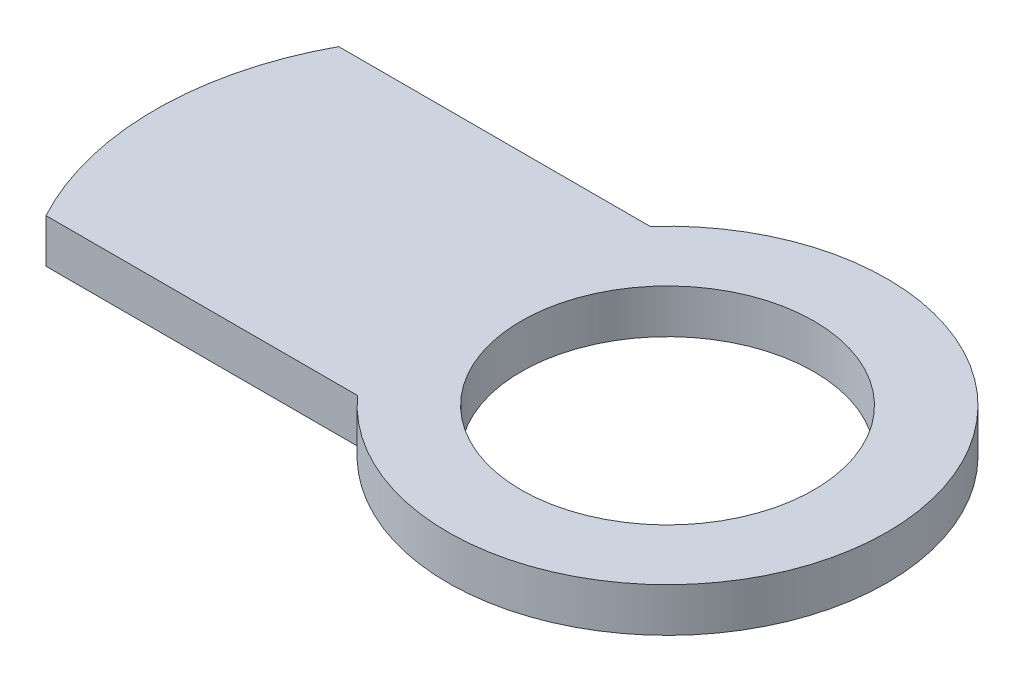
ISO-10303-21;
HEADER;
FILE_DESCRIPTION(('STEP AP214'),'2;1');
FILE_NAME('part.step','',(''),(''),'','','');
FILE_SCHEMA(('AUTOMOTIVE_DESIGN { 1 0 10303 214 1 1 1 1 }'));
ENDSEC;
DATA;
#1=APPLICATION_CONTEXT('core data for automotive mechanical design processes');
#2=APPLICATION_PROTOCOL_DEFINITION('international standard','automotive_design',2000,#1);
#3=PRODUCT_CONTEXT('',#1,'mechanical');
#4=PRODUCT('Part','Part','',(#3));
#5=PRODUCT_RELATED_PRODUCT_CATEGORY('part','',(#4));
#6=PRODUCT_DEFINITION_FORMATION('','',#4);
#7=PRODUCT_DEFINITION_CONTEXT('part definition',#1,'design');
#8=PRODUCT_DEFINITION('design','',#6,#7);
#9=PRODUCT_DEFINITION_SHAPE('','',#8);
#10=(LENGTH_UNIT() NAMED_UNIT(*) SI_UNIT(.MILLI.,.METRE.));
#11=(NAMED_UNIT(*) PLANE_ANGLE_UNIT() SI_UNIT($,.RADIAN.));
#12=(NAMED_UNIT(*) SI_UNIT($,.STERADIAN.) SOLID_ANGLE_UNIT());
#13=UNCERTAINTY_MEASURE_WITH_UNIT(LENGTH_MEASURE(1.E-05),#10,'distance_accuracy_value','');
#14=(GEOMETRIC_REPRESENTATION_CONTEXT(3) GLOBAL_UNCERTAINTY_ASSIGNED_CONTEXT((#13)) GLOBAL_UNIT_ASSIGNED_CONTEXT((#10,
#11,#12)) REPRESENTATION_CONTEXT('',''));
#15=CARTESIAN_POINT('',(0.,0.,0.));
#16=DIRECTION('',(0.,0.,1.));
#17=DIRECTION('',(1.,0.,0.));
#18=AXIS2_PLACEMENT_3D('',#15,#16,#17);
#19=CARTESIAN_POINT('',(0.,3.,0.));
#20=DIRECTION('',(0.,1.,0.));
#21=DIRECTION('',(0.,0.,1.));
#22=AXIS2_PLACEMENT_3D('',#19,#20,#21);
#23=PLANE('',#22);
#24=CARTESIAN_POINT('',(0.,3.,0.));
#25=DIRECTION('',(0.,1.,0.));
#26=DIRECTION('',(0.,0.,1.));
#27=AXIS2_PLACEMENT_3D('',#24,#25,#26);
#28=CIRCLE('',#27,15.);
#29=CARTESIAN_POINT('',(-11.1803398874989,3.,10.));
#30=VERTEX_POINT('',#29);
#31=CARTESIAN_POINT('',(-11.1803398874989,3.,-10.));
#32=VERTEX_POINT('',#31);
#33=EDGE_CURVE('E83',#30,#32,#28,.T.);
#34=ORIENTED_EDGE('',*,*,#33,.T.);
#35=DIRECTION('',(-1.,0.,0.));
#36=VECTOR('',#35,1.);
#37=CARTESIAN_POINT('',(-11.1803398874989,3.,-10.));
#38=LINE('',#37,#36);
#39=CARTESIAN_POINT('',(-32.4661853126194,3.,-10.));
#40=VERTEX_POINT('',#39);
#41=EDGE_CURVE('E78',#32,#40,#38,.T.);
#42=ORIENTED_EDGE('',*,*,#41,.T.);
#43=CARTESIAN_POINT('',(-14.,3.,0.));
#44=DIRECTION('',(0.,1.,0.));
#45=DIRECTION('',(0.,0.,1.));
#46=AXIS2_PLACEMENT_3D('',#43,#44,#45);
#47=CIRCLE('',#46,21.);
#48=CARTESIAN_POINT('',(-32.4661853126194,3.,10.));
#49=VERTEX_POINT('',#48);
#50=EDGE_CURVE('E81',#40,#49,#47,.T.);
#51=ORIENTED_EDGE('',*,*,#50,.T.);
#52=DIRECTION('',(1.,0.,0.));
#53=VECTOR('',#52,1.);
#54=CARTESIAN_POINT('',(-11.1803398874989,3.,10.));
#55=LINE('',#54,#53);
#56=EDGE_CURVE('E48',#49,#30,#55,.T.);
#57=ORIENTED_EDGE('',*,*,#56,.T.);
#58=EDGE_LOOP('',(#34,#42,#51,#57));
#59=FACE_BOUND('',#58,.T.);
#60=CARTESIAN_POINT('',(0.,3.,0.));
#61=DIRECTION('',(0.,1.,0.));
#62=DIRECTION('',(0.,0.,1.));
#63=AXIS2_PLACEMENT_3D('',#60,#61,#62);
#64=CIRCLE('',#63,10.);
#65=CARTESIAN_POINT('',(0.,3.,10.));
#66=VERTEX_POINT('',#65);
#67=EDGE_CURVE('E98',#66,#66,#64,.T.);
#68=ORIENTED_EDGE('',*,*,#67,.F.);
#69=EDGE_LOOP('',(#68));
#70=FACE_BOUND('',#69,.T.);
#71=ADVANCED_FACE('F31',(#59,#70),#23,.T.);
#72=CARTESIAN_POINT('',(0.,0.,0.));
#73=DIRECTION('',(0.,1.,0.));
#74=DIRECTION('',(0.,0.,1.));
#75=AXIS2_PLACEMENT_3D('',#72,#73,#74);
#76=PLANE('',#75);
#77=CARTESIAN_POINT('',(0.,0.,0.));
#78=DIRECTION('',(0.,1.,0.));
#79=DIRECTION('',(0.,0.,1.));
#80=AXIS2_PLACEMENT_3D('',#77,#78,#79);
#81=CIRCLE('',#80,15.);
#82=CARTESIAN_POINT('',(-11.1803398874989,0.,10.));
#83=VERTEX_POINT('',#82);
#84=CARTESIAN_POINT('',(-11.1803398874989,0.,-10.));
#85=VERTEX_POINT('',#84);
#86=EDGE_CURVE('E95',#83,#85,#81,.T.);
#87=ORIENTED_EDGE('',*,*,#86,.F.);
#88=DIRECTION('',(1.,0.,0.));
#89=VECTOR('',#88,1.);
#90=CARTESIAN_POINT('',(-11.1803398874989,0.,10.));
#91=LINE('',#90,#89);
#92=CARTESIAN_POINT('',(-32.4661853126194,0.,10.));
#93=VERTEX_POINT('',#92);
#94=EDGE_CURVE('E71',#93,#83,#91,.T.);
#95=ORIENTED_EDGE('',*,*,#94,.F.);
#96=CARTESIAN_POINT('',(-14.,0.,0.));
#97=DIRECTION('',(0.,1.,0.));
#98=DIRECTION('',(0.,0.,1.));
#99=AXIS2_PLACEMENT_3D('',#96,#97,#98);
#100=CIRCLE('',#99,21.);
#101=CARTESIAN_POINT('',(-32.4661853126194,0.,-10.));
#102=VERTEX_POINT('',#101);
#103=EDGE_CURVE('E65',#102,#93,#100,.T.);
#104=ORIENTED_EDGE('',*,*,#103,.F.);
#105=DIRECTION('',(-1.,0.,0.));
#106=VECTOR('',#105,1.);
#107=CARTESIAN_POINT('',(-11.1803398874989,0.,-10.));
#108=LINE('',#107,#106);
#109=EDGE_CURVE('E87',#85,#102,#108,.T.);
#110=ORIENTED_EDGE('',*,*,#109,.F.);
#111=EDGE_LOOP('',(#87,#95,#104,#110));
#112=FACE_BOUND('',#111,.T.);
#113=CARTESIAN_POINT('',(0.,0.,0.));
#114=DIRECTION('',(0.,1.,0.));
#115=DIRECTION('',(0.,0.,1.));
#116=AXIS2_PLACEMENT_3D('',#113,#114,#115);
#117=CIRCLE('',#116,10.);
#118=CARTESIAN_POINT('',(0.,0.,10.));
#119=VERTEX_POINT('',#118);
#120=EDGE_CURVE('E110',#119,#119,#117,.T.);
#121=ORIENTED_EDGE('',*,*,#120,.T.);
#122=EDGE_LOOP('',(#121));
#123=FACE_BOUND('',#122,.T.);
#124=ADVANCED_FACE('F106',(#112,#123),#76,.F.);
#125=CARTESIAN_POINT('',(0.,3.,0.));
#126=DIRECTION('',(0.,-1.,0.));
#127=DIRECTION('',(0.,0.,-1.));
#128=AXIS2_PLACEMENT_3D('',#125,#126,#127);
#129=CYLINDRICAL_SURFACE('',#128,15.);
#130=ORIENTED_EDGE('',*,*,#86,.T.);
#131=DIRECTION('',(0.,-1.,0.));
#132=VECTOR('',#131,1.);
#133=CARTESIAN_POINT('',(-11.1803398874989,3.,-10.));
#134=LINE('',#133,#132);
#135=EDGE_CURVE('E11',#32,#85,#134,.T.);
#136=ORIENTED_EDGE('',*,*,#135,.F.);
#137=ORIENTED_EDGE('',*,*,#33,.F.);
#138=DIRECTION('',(0.,-1.,0.));
#139=VECTOR('',#138,1.);
#140=CARTESIAN_POINT('',(-11.1803398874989,3.,10.));
#141=LINE('',#140,#139);
#142=EDGE_CURVE('E91',#30,#83,#141,.T.);
#143=ORIENTED_EDGE('',*,*,#142,.T.);
#144=EDGE_LOOP('',(#130,#136,#137,#143));
#145=FACE_BOUND('',#144,.T.);
#146=ADVANCED_FACE('F33',(#145),#129,.T.);
#147=CARTESIAN_POINT('',(-11.1803398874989,3.,-10.));
#148=DIRECTION('',(0.,0.,1.));
#149=DIRECTION('',(1.,0.,0.));
#150=AXIS2_PLACEMENT_3D('',#147,#148,#149);
#151=PLANE('',#150);
#152=ORIENTED_EDGE('',*,*,#109,.T.);
#153=DIRECTION('',(0.,-1.,0.));
#154=VECTOR('',#153,1.);
#155=CARTESIAN_POINT('',(-32.4661853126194,3.,-10.));
#156=LINE('',#155,#154);
#157=EDGE_CURVE('E40',#40,#102,#156,.T.);
#158=ORIENTED_EDGE('',*,*,#157,.F.);
#159=ORIENTED_EDGE('',*,*,#41,.F.);
#160=ORIENTED_EDGE('',*,*,#135,.T.);
#161=EDGE_LOOP('',(#152,#158,#159,#160));
#162=FACE_BOUND('',#161,.T.);
#163=ADVANCED_FACE('F86',(#162),#151,.F.);
#164=CARTESIAN_POINT('',(-14.,3.,0.));
#165=DIRECTION('',(0.,-1.,0.));
#166=DIRECTION('',(0.,0.,-1.));
#167=AXIS2_PLACEMENT_3D('',#164,#165,#166);
#168=CYLINDRICAL_SURFACE('',#167,21.);
#169=ORIENTED_EDGE('',*,*,#103,.T.);
#170=DIRECTION('',(0.,-1.,0.));
#171=VECTOR('',#170,1.);
#172=CARTESIAN_POINT('',(-32.4661853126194,3.,10.));
#173=LINE('',#172,#171);
#174=EDGE_CURVE('E88',#49,#93,#173,.T.);
#175=ORIENTED_EDGE('',*,*,#174,.F.);
#176=ORIENTED_EDGE('',*,*,#50,.F.);
#177=ORIENTED_EDGE('',*,*,#157,.T.);
#178=EDGE_LOOP('',(#169,#175,#176,#177));
#179=FACE_BOUND('',#178,.T.);
#180=ADVANCED_FACE('F89',(#179),#168,.T.);
#181=CARTESIAN_POINT('',(-11.1803398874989,3.,10.));
#182=DIRECTION('',(0.,0.,-1.));
#183=DIRECTION('',(-1.,0.,0.));
#184=AXIS2_PLACEMENT_3D('',#181,#182,#183);
#185=PLANE('',#184);
#186=ORIENTED_EDGE('',*,*,#94,.T.);
#187=ORIENTED_EDGE('',*,*,#142,.F.);
#188=ORIENTED_EDGE('',*,*,#56,.F.);
#189=ORIENTED_EDGE('',*,*,#174,.T.);
#190=EDGE_LOOP('',(#186,#187,#188,#189));
#191=FACE_BOUND('',#190,.T.);
#192=ADVANCED_FACE('F103',(#191),#185,.F.);
#193=CARTESIAN_POINT('',(0.,3.,0.));
#194=DIRECTION('',(0.,-1.,0.));
#195=DIRECTION('',(0.,0.,-1.));
#196=AXIS2_PLACEMENT_3D('',#193,#194,#195);
#197=CYLINDRICAL_SURFACE('',#196,10.);
#198=ORIENTED_EDGE('',*,*,#67,.T.);
#199=EDGE_LOOP('',(#198));
#200=FACE_BOUND('',#199,.T.);
#201=ORIENTED_EDGE('',*,*,#120,.F.);
#202=EDGE_LOOP('',(#201));
#203=FACE_BOUND('',#202,.T.);
#204=ADVANCED_FACE('F116',(#200,#203),#197,.F.);
#205=CLOSED_SHELL('',(#71,#124,#146,#163,#180,#192,#204));
#206=MANIFOLD_SOLID_BREP('B2',#205);
#207=ADVANCED_BREP_SHAPE_REPRESENTATION('',(#18,#206),#14);
#208=SHAPE_DEFINITION_REPRESENTATION(#9,#207);
ENDSEC;
END-ISO-10303-21;
